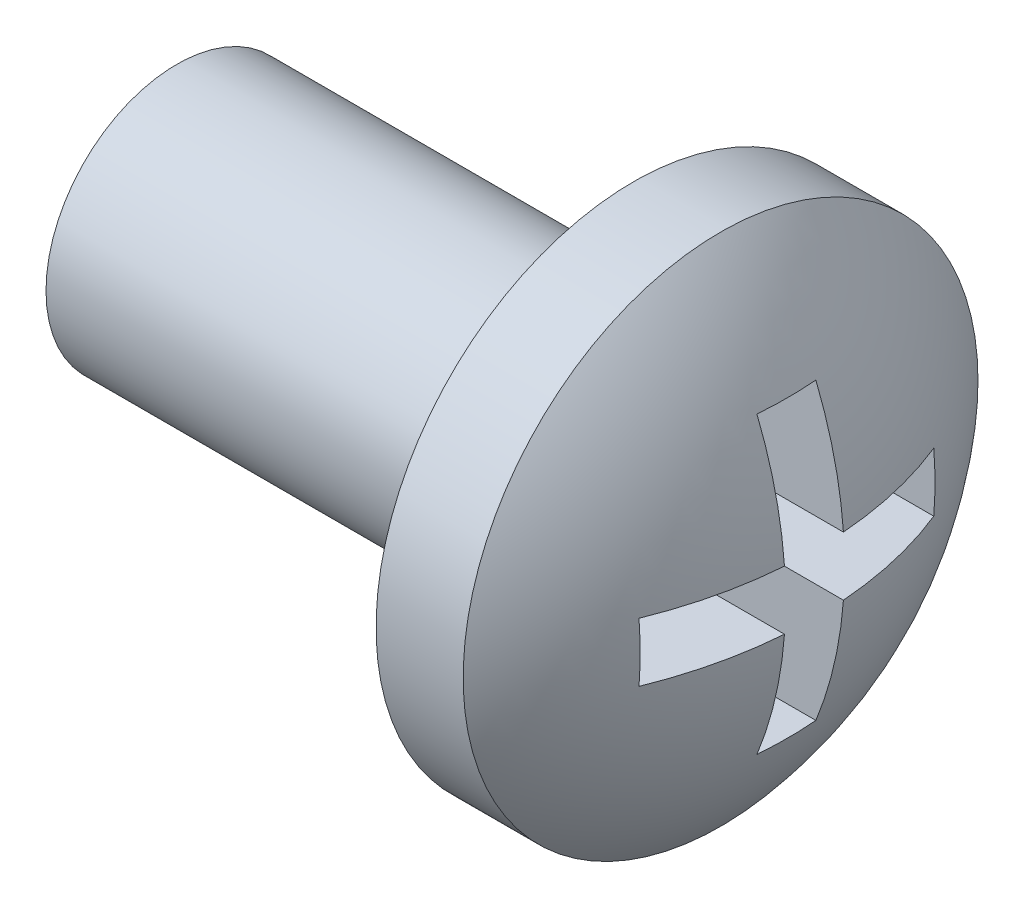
ISO-10303-21;
HEADER;
FILE_DESCRIPTION(('STEP AP214'),'2;1');
FILE_NAME('part.step','',(''),(''),'','','');
FILE_SCHEMA(('AUTOMOTIVE_DESIGN { 1 0 10303 214 1 1 1 1 }'));
ENDSEC;
DATA;
#1=APPLICATION_CONTEXT('core data for automotive mechanical design processes');
#2=APPLICATION_PROTOCOL_DEFINITION('international standard','automotive_design',2000,#1);
#3=PRODUCT_CONTEXT('',#1,'mechanical');
#4=PRODUCT('Part','Part','',(#3));
#5=PRODUCT_RELATED_PRODUCT_CATEGORY('part','',(#4));
#6=PRODUCT_DEFINITION_FORMATION('','',#4);
#7=PRODUCT_DEFINITION_CONTEXT('part definition',#1,'design');
#8=PRODUCT_DEFINITION('design','',#6,#7);
#9=PRODUCT_DEFINITION_SHAPE('','',#8);
#10=(LENGTH_UNIT() NAMED_UNIT(*) SI_UNIT(.MILLI.,.METRE.));
#11=(NAMED_UNIT(*) PLANE_ANGLE_UNIT() SI_UNIT($,.RADIAN.));
#12=(NAMED_UNIT(*) SI_UNIT($,.STERADIAN.) SOLID_ANGLE_UNIT());
#13=UNCERTAINTY_MEASURE_WITH_UNIT(LENGTH_MEASURE(1.E-05),#10,'distance_accuracy_value','');
#14=(GEOMETRIC_REPRESENTATION_CONTEXT(3) GLOBAL_UNCERTAINTY_ASSIGNED_CONTEXT((#13)) GLOBAL_UNIT_ASSIGNED_CONTEXT((#10,
#11,#12)) REPRESENTATION_CONTEXT('',''));
#15=CARTESIAN_POINT('',(0.,0.,0.));
#16=DIRECTION('',(0.,0.,1.));
#17=DIRECTION('',(1.,0.,0.));
#18=AXIS2_PLACEMENT_3D('',#15,#16,#17);
#19=CARTESIAN_POINT('',(13.8,0.,12.45));
#20=DIRECTION('',(0.,0.,1.));
#21=DIRECTION('',(1.,0.,0.));
#22=AXIS2_PLACEMENT_3D('',#19,#20,#21);
#23=PLANE('',#22);
#24=DIRECTION('',(0.,1.,0.));
#25=VECTOR('',#24,1.);
#26=CARTESIAN_POINT('',(12.2,0.,12.45));
#27=LINE('',#26,#25);
#28=CARTESIAN_POINT('',(12.2,0.71,12.45));
#29=VERTEX_POINT('',#28);
#30=CARTESIAN_POINT('',(12.2,-0.71,12.45));
#31=VERTEX_POINT('',#30);
#32=EDGE_CURVE('E182',#29,#31,#27,.F.);
#33=ORIENTED_EDGE('',*,*,#32,.T.);
#34=DIRECTION('',(1.,0.,0.));
#35=VECTOR('',#34,1.);
#36=CARTESIAN_POINT('',(13.8,-0.71,12.45));
#37=LINE('',#36,#35);
#38=CARTESIAN_POINT('',(14.6831315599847,-0.710000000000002,12.45));
#39=VERTEX_POINT('',#38);
#40=EDGE_CURVE('E120',#39,#31,#37,.F.);
#41=ORIENTED_EDGE('',*,*,#40,.F.);
#42=CARTESIAN_POINT('',(14.6831315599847,-0.710000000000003,12.45));
#43=CARTESIAN_POINT('',(14.7022317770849,-0.473333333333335,12.45));
#44=CARTESIAN_POINT('',(14.711781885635,-0.236666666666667,12.45));
#45=CARTESIAN_POINT('',(14.711781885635,0.236666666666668,12.45));
#46=CARTESIAN_POINT('',(14.7022317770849,0.473333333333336,12.45));
#47=CARTESIAN_POINT('',(14.6831315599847,0.710000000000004,12.45));
#48=B_SPLINE_CURVE_WITH_KNOTS('',3,(#42,#43,#44,#45,#46,#47),.UNSPECIFIED.,.F.,.F.,(4,2,4),(0.,
0.710577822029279,1.42115564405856),.UNSPECIFIED.);
#49=CARTESIAN_POINT('',(14.6831315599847,0.710000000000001,12.45));
#50=VERTEX_POINT('',#49);
#51=EDGE_CURVE('E112',#39,#50,#48,.T.);
#52=ORIENTED_EDGE('',*,*,#51,.T.);
#53=DIRECTION('',(1.,0.,0.));
#54=VECTOR('',#53,1.);
#55=CARTESIAN_POINT('',(13.8,0.71,12.45));
#56=LINE('',#55,#54);
#57=EDGE_CURVE('E117',#29,#50,#56,.T.);
#58=ORIENTED_EDGE('',*,*,#57,.F.);
#59=EDGE_LOOP('',(#33,#41,#52,#58));
#60=FACE_BOUND('',#59,.T.);
#61=ADVANCED_FACE('F16',(#60),#23,.T.);
#62=CARTESIAN_POINT('',(13.8,-3.55,16.));
#63=DIRECTION('',(0.,1.,0.));
#64=DIRECTION('',(0.,0.,1.));
#65=AXIS2_PLACEMENT_3D('',#62,#63,#64);
#66=PLANE('',#65);
#67=DIRECTION('',(-1.,0.,0.));
#68=VECTOR('',#67,1.);
#69=CARTESIAN_POINT('',(13.8,-3.55,16.71));
#70=LINE('',#69,#68);
#71=CARTESIAN_POINT('',(14.6831315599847,-3.55,16.71));
#72=VERTEX_POINT('',#71);
#73=CARTESIAN_POINT('',(12.2,-3.55,16.71));
#74=VERTEX_POINT('',#73);
#75=EDGE_CURVE('E252',#72,#74,#70,.T.);
#76=ORIENTED_EDGE('',*,*,#75,.F.);
#77=CARTESIAN_POINT('',(5.9,-3.55,16.));
#78=DIRECTION('',(0.,1.,0.));
#79=DIRECTION('',(0.,0.,1.));
#80=AXIS2_PLACEMENT_3D('',#77,#78,#79);
#81=CIRCLE('',#80,8.81178188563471);
#82=CARTESIAN_POINT('',(14.6831315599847,-3.55,15.29));
#83=VERTEX_POINT('',#82);
#84=EDGE_CURVE('E122',#72,#83,#81,.T.);
#85=ORIENTED_EDGE('',*,*,#84,.T.);
#86=DIRECTION('',(1.,0.,0.));
#87=VECTOR('',#86,1.);
#88=CARTESIAN_POINT('',(13.8,-3.55,15.29));
#89=LINE('',#88,#87);
#90=CARTESIAN_POINT('',(12.2,-3.55,15.29));
#91=VERTEX_POINT('',#90);
#92=EDGE_CURVE('E248',#91,#83,#89,.T.);
#93=ORIENTED_EDGE('',*,*,#92,.F.);
#94=DIRECTION('',(0.,0.,1.));
#95=VECTOR('',#94,1.);
#96=CARTESIAN_POINT('',(12.2,-3.55,16.));
#97=LINE('',#96,#95);
#98=EDGE_CURVE('E299',#91,#74,#97,.T.);
#99=ORIENTED_EDGE('',*,*,#98,.T.);
#100=EDGE_LOOP('',(#76,#85,#93,#99));
#101=FACE_BOUND('',#100,.T.);
#102=ADVANCED_FACE('F175',(#101),#66,.T.);
#103=CARTESIAN_POINT('',(13.8,0.,19.55));
#104=DIRECTION('',(0.,0.,-1.));
#105=DIRECTION('',(-1.,0.,0.));
#106=AXIS2_PLACEMENT_3D('',#103,#104,#105);
#107=PLANE('',#106);
#108=DIRECTION('',(0.,1.,0.));
#109=VECTOR('',#108,1.);
#110=CARTESIAN_POINT('',(12.2,0.,19.55));
#111=LINE('',#110,#109);
#112=CARTESIAN_POINT('',(12.2,-0.71,19.55));
#113=VERTEX_POINT('',#112);
#114=CARTESIAN_POINT('',(12.2,0.71,19.55));
#115=VERTEX_POINT('',#114);
#116=EDGE_CURVE('E284',#113,#115,#111,.T.);
#117=ORIENTED_EDGE('',*,*,#116,.T.);
#118=DIRECTION('',(1.,0.,0.));
#119=VECTOR('',#118,1.);
#120=CARTESIAN_POINT('',(13.8,0.71,19.55));
#121=LINE('',#120,#119);
#122=CARTESIAN_POINT('',(14.6831315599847,0.710000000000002,19.55));
#123=VERTEX_POINT('',#122);
#124=EDGE_CURVE('E295',#123,#115,#121,.F.);
#125=ORIENTED_EDGE('',*,*,#124,.F.);
#126=CARTESIAN_POINT('',(14.6831315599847,0.710000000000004,19.55));
#127=CARTESIAN_POINT('',(14.7022317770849,0.473333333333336,19.55));
#128=CARTESIAN_POINT('',(14.711781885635,0.236666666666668,19.55));
#129=CARTESIAN_POINT('',(14.711781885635,-0.236666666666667,19.55));
#130=CARTESIAN_POINT('',(14.7022317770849,-0.473333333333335,19.55));
#131=CARTESIAN_POINT('',(14.6831315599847,-0.710000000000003,19.55));
#132=B_SPLINE_CURVE_WITH_KNOTS('',3,(#126,#127,#128,#129,#130,#131),.UNSPECIFIED.,.F.,.F.,(4,2,
4),(0.,0.710577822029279,1.42115564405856),.UNSPECIFIED.);
#133=CARTESIAN_POINT('',(14.6831315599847,-0.710000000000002,19.55));
#134=VERTEX_POINT('',#133);
#135=EDGE_CURVE('E177',#123,#134,#132,.T.);
#136=ORIENTED_EDGE('',*,*,#135,.T.);
#137=DIRECTION('',(1.,0.,0.));
#138=VECTOR('',#137,1.);
#139=CARTESIAN_POINT('',(13.8,-0.71,19.55));
#140=LINE('',#139,#138);
#141=EDGE_CURVE('E305',#113,#134,#140,.T.);
#142=ORIENTED_EDGE('',*,*,#141,.F.);
#143=EDGE_LOOP('',(#117,#125,#136,#142));
#144=FACE_BOUND('',#143,.T.);
#145=ADVANCED_FACE('F171',(#144),#107,.T.);
#146=CARTESIAN_POINT('',(12.2,0.,16.));
#147=DIRECTION('',(-1.,0.,0.));
#148=DIRECTION('',(0.,0.,1.));
#149=AXIS2_PLACEMENT_3D('',#146,#147,#148);
#150=PLANE('',#149);
#151=DIRECTION('',(0.,0.,-1.));
#152=VECTOR('',#151,1.);
#153=CARTESIAN_POINT('',(12.2,3.55,16.));
#154=LINE('',#153,#152);
#155=CARTESIAN_POINT('',(12.2,3.55,16.71));
#156=VERTEX_POINT('',#155);
#157=CARTESIAN_POINT('',(12.2,3.55,15.29));
#158=VERTEX_POINT('',#157);
#159=EDGE_CURVE('E282',#156,#158,#154,.T.);
#160=ORIENTED_EDGE('',*,*,#159,.F.);
#161=DIRECTION('',(0.,1.,0.));
#162=VECTOR('',#161,1.);
#163=CARTESIAN_POINT('',(12.2,0.,16.71));
#164=LINE('',#163,#162);
#165=CARTESIAN_POINT('',(12.2,0.71,16.71));
#166=VERTEX_POINT('',#165);
#167=EDGE_CURVE('E287',#166,#156,#164,.T.);
#168=ORIENTED_EDGE('',*,*,#167,.F.);
#169=DIRECTION('',(0.,0.,-1.));
#170=VECTOR('',#169,1.);
#171=CARTESIAN_POINT('',(12.2,0.71,16.));
#172=LINE('',#171,#170);
#173=EDGE_CURVE('E293',#115,#166,#172,.T.);
#174=ORIENTED_EDGE('',*,*,#173,.F.);
#175=ORIENTED_EDGE('',*,*,#116,.F.);
#176=DIRECTION('',(0.,0.,1.));
#177=VECTOR('',#176,1.);
#178=CARTESIAN_POINT('',(12.2,-0.71,16.));
#179=LINE('',#178,#177);
#180=CARTESIAN_POINT('',(12.2,-0.71,16.71));
#181=VERTEX_POINT('',#180);
#182=EDGE_CURVE('E302',#181,#113,#179,.T.);
#183=ORIENTED_EDGE('',*,*,#182,.F.);
#184=DIRECTION('',(0.,1.,0.));
#185=VECTOR('',#184,1.);
#186=CARTESIAN_POINT('',(12.2,0.,16.71));
#187=LINE('',#186,#185);
#188=EDGE_CURVE('E255',#74,#181,#187,.T.);
#189=ORIENTED_EDGE('',*,*,#188,.F.);
#190=ORIENTED_EDGE('',*,*,#98,.F.);
#191=DIRECTION('',(0.,1.,0.));
#192=VECTOR('',#191,1.);
#193=CARTESIAN_POINT('',(12.2,0.,15.29));
#194=LINE('',#193,#192);
#195=CARTESIAN_POINT('',(12.2,-0.71,15.29));
#196=VERTEX_POINT('',#195);
#197=EDGE_CURVE('E250',#196,#91,#194,.F.);
#198=ORIENTED_EDGE('',*,*,#197,.F.);
#199=DIRECTION('',(0.,0.,1.));
#200=VECTOR('',#199,1.);
#201=CARTESIAN_POINT('',(12.2,-0.71,16.));
#202=LINE('',#201,#200);
#203=EDGE_CURVE('E264',#31,#196,#202,.T.);
#204=ORIENTED_EDGE('',*,*,#203,.F.);
#205=ORIENTED_EDGE('',*,*,#32,.F.);
#206=DIRECTION('',(0.,0.,-1.));
#207=VECTOR('',#206,1.);
#208=CARTESIAN_POINT('',(12.2,0.71,16.));
#209=LINE('',#208,#207);
#210=CARTESIAN_POINT('',(12.2,0.71,15.29));
#211=VERTEX_POINT('',#210);
#212=EDGE_CURVE('E131',#211,#29,#209,.T.);
#213=ORIENTED_EDGE('',*,*,#212,.F.);
#214=DIRECTION('',(0.,1.,0.));
#215=VECTOR('',#214,1.);
#216=CARTESIAN_POINT('',(12.2,0.,15.29));
#217=LINE('',#216,#215);
#218=EDGE_CURVE('E274',#158,#211,#217,.F.);
#219=ORIENTED_EDGE('',*,*,#218,.F.);
#220=EDGE_LOOP('',(#160,#168,#174,#175,#183,#189,#190,#198,#204,#205,#213,#219));
#221=FACE_BOUND('',#220,.T.);
#222=ADVANCED_FACE('F167',(#221),#150,.F.);
#223=CARTESIAN_POINT('',(13.8,3.55,16.));
#224=DIRECTION('',(0.,-1.,0.));
#225=DIRECTION('',(0.,0.,-1.));
#226=AXIS2_PLACEMENT_3D('',#223,#224,#225);
#227=PLANE('',#226);
#228=DIRECTION('',(1.,0.,0.));
#229=VECTOR('',#228,1.);
#230=CARTESIAN_POINT('',(13.8,3.55,15.29));
#231=LINE('',#230,#229);
#232=CARTESIAN_POINT('',(14.6831315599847,3.55,15.29));
#233=VERTEX_POINT('',#232);
#234=EDGE_CURVE('E277',#233,#158,#231,.F.);
#235=ORIENTED_EDGE('',*,*,#234,.F.);
#236=CARTESIAN_POINT('',(5.9,3.55,16.));
#237=DIRECTION('',(0.,1.,0.));
#238=DIRECTION('',(0.,0.,1.));
#239=AXIS2_PLACEMENT_3D('',#236,#237,#238);
#240=CIRCLE('',#239,8.81178188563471);
#241=CARTESIAN_POINT('',(14.6831315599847,3.55,16.71));
#242=VERTEX_POINT('',#241);
#243=EDGE_CURVE('E151',#233,#242,#240,.F.);
#244=ORIENTED_EDGE('',*,*,#243,.T.);
#245=DIRECTION('',(-1.,0.,0.));
#246=VECTOR('',#245,1.);
#247=CARTESIAN_POINT('',(13.8,3.55,16.71));
#248=LINE('',#247,#246);
#249=EDGE_CURVE('E142',#156,#242,#248,.F.);
#250=ORIENTED_EDGE('',*,*,#249,.F.);
#251=ORIENTED_EDGE('',*,*,#159,.T.);
#252=EDGE_LOOP('',(#235,#244,#250,#251));
#253=FACE_BOUND('',#252,.T.);
#254=ADVANCED_FACE('F162',(#253),#227,.T.);
#255=CARTESIAN_POINT('',(13.8,0.,15.29));
#256=DIRECTION('',(0.,0.,1.));
#257=DIRECTION('',(1.,0.,0.));
#258=AXIS2_PLACEMENT_3D('',#255,#256,#257);
#259=PLANE('',#258);
#260=ORIENTED_EDGE('',*,*,#234,.T.);
#261=ORIENTED_EDGE('',*,*,#218,.T.);
#262=DIRECTION('',(1.,0.,0.));
#263=VECTOR('',#262,1.);
#264=CARTESIAN_POINT('',(13.8,0.71,15.29));
#265=LINE('',#264,#263);
#266=CARTESIAN_POINT('',(15.346787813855,0.71,15.29));
#267=VERTEX_POINT('',#266);
#268=EDGE_CURVE('E272',#267,#211,#265,.F.);
#269=ORIENTED_EDGE('',*,*,#268,.F.);
#270=CARTESIAN_POINT('',(14.6831315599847,3.55000000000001,15.29));
#271=CARTESIAN_POINT('',(14.7199171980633,3.45898926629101,15.29));
#272=CARTESIAN_POINT('',(14.7552872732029,3.36740643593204,15.29));
#273=CARTESIAN_POINT('',(14.8230352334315,3.18353616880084,15.29));
#274=CARTESIAN_POINT('',(14.8554239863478,3.09125273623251,15.29));
#275=CARTESIAN_POINT('',(14.9172403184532,2.9059914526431,15.29));
#276=CARTESIAN_POINT('',(14.9466760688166,2.81301632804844,15.29));
#277=CARTESIAN_POINT('',(15.0026097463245,2.62637926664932,15.29));
#278=CARTESIAN_POINT('',(15.0291131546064,2.5327189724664,15.29));
#279=CARTESIAN_POINT('',(15.0791971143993,2.34471632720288,15.29));
#280=CARTESIAN_POINT('',(15.1027804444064,2.25037471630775,15.29));
#281=CARTESIAN_POINT('',(15.147031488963,2.06101016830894,15.29));
#282=CARTESIAN_POINT('',(15.1676992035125,1.96598723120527,15.29));
#283=CARTESIAN_POINT('',(15.2061178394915,1.77525861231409,15.29));
#284=CARTESIAN_POINT('',(15.2238659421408,1.67955236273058,15.29));
#285=CARTESIAN_POINT('',(15.2564354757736,1.48745552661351,15.29));
#286=CARTESIAN_POINT('',(15.271251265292,1.39106398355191,15.29));
#287=CARTESIAN_POINT('',(15.2979376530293,1.1975934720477,15.29));
#288=CARTESIAN_POINT('',(15.3097997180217,1.10051332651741,15.29));
#289=CARTESIAN_POINT('',(15.3305523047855,0.905661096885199,15.29));
#290=CARTESIAN_POINT('',(15.3394313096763,0.8078877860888,15.29));
#291=CARTESIAN_POINT('',(15.346787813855,0.710000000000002,15.29));
#292=B_SPLINE_CURVE_WITH_KNOTS('',3,(#270,#271,#272,#273,#274,#275,#276,#277,#278,#279,#280,
#281,#282,#283,#284,#285,#286,#287,#288,#289,#290,#291),.UNSPECIFIED.,.F.,.F.,(4,2,2,2,2,2,2,2,
2,2,4),(0.,0.294479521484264,0.587839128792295,0.880363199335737,1.17233090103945,
1.4640186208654,1.75570634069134,2.04767404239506,2.3401981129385,2.63355772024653,
2.9280372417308),.UNSPECIFIED.);
#293=EDGE_CURVE('E137',#233,#267,#292,.T.);
#294=ORIENTED_EDGE('',*,*,#293,.F.);
#295=EDGE_LOOP('',(#260,#261,#269,#294));
#296=FACE_BOUND('',#295,.T.);
#297=ADVANCED_FACE('F157',(#296),#259,.T.);
#298=CARTESIAN_POINT('',(13.8,0.71,16.));
#299=DIRECTION('',(0.,-1.,0.));
#300=DIRECTION('',(0.,0.,-1.));
#301=AXIS2_PLACEMENT_3D('',#298,#299,#300);
#302=PLANE('',#301);
#303=ORIENTED_EDGE('',*,*,#212,.T.);
#304=ORIENTED_EDGE('',*,*,#57,.T.);
#305=CARTESIAN_POINT('',(5.9,0.71,16.));
#306=DIRECTION('',(0.,1.,0.));
#307=DIRECTION('',(0.,0.,1.));
#308=AXIS2_PLACEMENT_3D('',#305,#306,#307);
#309=CIRCLE('',#308,9.47343126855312);
#310=EDGE_CURVE('E128',#267,#50,#309,.T.);
#311=ORIENTED_EDGE('',*,*,#310,.F.);
#312=ORIENTED_EDGE('',*,*,#268,.T.);
#313=EDGE_LOOP('',(#303,#304,#311,#312));
#314=FACE_BOUND('',#313,.T.);
#315=ADVANCED_FACE('F126',(#314),#302,.T.);
#316=CARTESIAN_POINT('',(13.8,-0.71,16.));
#317=DIRECTION('',(0.,1.,0.));
#318=DIRECTION('',(0.,0.,1.));
#319=AXIS2_PLACEMENT_3D('',#316,#317,#318);
#320=PLANE('',#319);
#321=ORIENTED_EDGE('',*,*,#203,.T.);
#322=DIRECTION('',(1.,0.,0.));
#323=VECTOR('',#322,1.);
#324=CARTESIAN_POINT('',(13.8,-0.71,15.29));
#325=LINE('',#324,#323);
#326=CARTESIAN_POINT('',(15.346787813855,-0.710000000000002,15.29));
#327=VERTEX_POINT('',#326);
#328=EDGE_CURVE('E246',#327,#196,#325,.F.);
#329=ORIENTED_EDGE('',*,*,#328,.F.);
#330=CARTESIAN_POINT('',(5.9,-0.710000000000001,16.));
#331=DIRECTION('',(0.,1.,0.));
#332=DIRECTION('',(0.,0.,1.));
#333=AXIS2_PLACEMENT_3D('',#330,#331,#332);
#334=CIRCLE('',#333,9.47343126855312);
#335=EDGE_CURVE('E138',#39,#327,#334,.F.);
#336=ORIENTED_EDGE('',*,*,#335,.F.);
#337=ORIENTED_EDGE('',*,*,#40,.T.);
#338=EDGE_LOOP('',(#321,#329,#336,#337));
#339=FACE_BOUND('',#338,.T.);
#340=ADVANCED_FACE('F331',(#339),#320,.T.);
#341=CARTESIAN_POINT('',(13.8,0.,15.29));
#342=DIRECTION('',(0.,0.,1.));
#343=DIRECTION('',(1.,0.,0.));
#344=AXIS2_PLACEMENT_3D('',#341,#342,#343);
#345=PLANE('',#344);
#346=ORIENTED_EDGE('',*,*,#92,.T.);
#347=CARTESIAN_POINT('',(15.346787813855,-0.710000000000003,15.29));
#348=CARTESIAN_POINT('',(15.3394313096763,-0.807887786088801,15.29));
#349=CARTESIAN_POINT('',(15.3305523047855,-0.9056610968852,15.29));
#350=CARTESIAN_POINT('',(15.3097997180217,-1.10051332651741,15.29));
#351=CARTESIAN_POINT('',(15.2979376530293,-1.1975934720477,15.29));
#352=CARTESIAN_POINT('',(15.271251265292,-1.39106398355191,15.29));
#353=CARTESIAN_POINT('',(15.2564354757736,-1.48745552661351,15.29));
#354=CARTESIAN_POINT('',(15.2238659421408,-1.67955236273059,15.29));
#355=CARTESIAN_POINT('',(15.2061178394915,-1.7752586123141,15.29));
#356=CARTESIAN_POINT('',(15.1676992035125,-1.96598723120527,15.29));
#357=CARTESIAN_POINT('',(15.147031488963,-2.06101016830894,15.29));
#358=CARTESIAN_POINT('',(15.1027804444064,-2.25037471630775,15.29));
#359=CARTESIAN_POINT('',(15.0791971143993,-2.34471632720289,15.29));
#360=CARTESIAN_POINT('',(15.0291131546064,-2.5327189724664,15.29));
#361=CARTESIAN_POINT('',(15.0026097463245,-2.62637926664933,15.29));
#362=CARTESIAN_POINT('',(14.9466760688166,-2.81301632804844,15.29));
#363=CARTESIAN_POINT('',(14.9172403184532,-2.90599145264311,15.29));
#364=CARTESIAN_POINT('',(14.8554239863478,-3.09125273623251,15.29));
#365=CARTESIAN_POINT('',(14.8230352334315,-3.18353616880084,15.29));
#366=CARTESIAN_POINT('',(14.7552872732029,-3.36740643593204,15.29));
#367=CARTESIAN_POINT('',(14.7199171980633,-3.45898926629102,15.29));
#368=CARTESIAN_POINT('',(14.6831315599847,-3.55000000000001,15.29));
#369=B_SPLINE_CURVE_WITH_KNOTS('',3,(#347,#348,#349,#350,#351,#352,#353,#354,#355,#356,#357,
#358,#359,#360,#361,#362,#363,#364,#365,#366,#367,#368),.UNSPECIFIED.,.F.,.F.,(4,2,2,2,2,2,2,2,
2,2,4),(0.,0.294479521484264,0.587839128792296,0.880363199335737,1.17233090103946,
1.4640186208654,1.75570634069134,2.04767404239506,2.3401981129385,2.63355772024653,
2.9280372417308),.UNSPECIFIED.);
#370=EDGE_CURVE('E140',#327,#83,#369,.T.);
#371=ORIENTED_EDGE('',*,*,#370,.F.);
#372=ORIENTED_EDGE('',*,*,#328,.T.);
#373=ORIENTED_EDGE('',*,*,#197,.T.);
#374=EDGE_LOOP('',(#346,#371,#372,#373));
#375=FACE_BOUND('',#374,.T.);
#376=ADVANCED_FACE('F227',(#375),#345,.T.);
#377=CARTESIAN_POINT('',(13.8,0.,16.71));
#378=DIRECTION('',(0.,0.,-1.));
#379=DIRECTION('',(-1.,0.,0.));
#380=AXIS2_PLACEMENT_3D('',#377,#378,#379);
#381=PLANE('',#380);
#382=ORIENTED_EDGE('',*,*,#75,.T.);
#383=ORIENTED_EDGE('',*,*,#188,.T.);
#384=DIRECTION('',(1.,0.,0.));
#385=VECTOR('',#384,1.);
#386=CARTESIAN_POINT('',(13.8,-0.71,16.71));
#387=LINE('',#386,#385);
#388=CARTESIAN_POINT('',(15.346787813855,-0.71,16.71));
#389=VERTEX_POINT('',#388);
#390=EDGE_CURVE('E306',#389,#181,#387,.F.);
#391=ORIENTED_EDGE('',*,*,#390,.F.);
#392=CARTESIAN_POINT('',(14.6831315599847,-3.55000000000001,16.71));
#393=CARTESIAN_POINT('',(14.7199171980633,-3.45898926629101,16.71));
#394=CARTESIAN_POINT('',(14.7552872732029,-3.36740643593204,16.71));
#395=CARTESIAN_POINT('',(14.8230352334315,-3.18353616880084,16.71));
#396=CARTESIAN_POINT('',(14.8554239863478,-3.09125273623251,16.71));
#397=CARTESIAN_POINT('',(14.9172403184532,-2.9059914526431,16.71));
#398=CARTESIAN_POINT('',(14.9466760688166,-2.81301632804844,16.71));
#399=CARTESIAN_POINT('',(15.0026097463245,-2.62637926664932,16.71));
#400=CARTESIAN_POINT('',(15.0291131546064,-2.5327189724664,16.71));
#401=CARTESIAN_POINT('',(15.0791971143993,-2.34471632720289,16.71));
#402=CARTESIAN_POINT('',(15.1027804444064,-2.25037471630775,16.71));
#403=CARTESIAN_POINT('',(15.147031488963,-2.06101016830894,16.71));
#404=CARTESIAN_POINT('',(15.1676992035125,-1.96598723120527,16.71));
#405=CARTESIAN_POINT('',(15.2061178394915,-1.7752586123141,16.71));
#406=CARTESIAN_POINT('',(15.2238659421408,-1.67955236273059,16.71));
#407=CARTESIAN_POINT('',(15.2564354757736,-1.48745552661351,16.71));
#408=CARTESIAN_POINT('',(15.271251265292,-1.39106398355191,16.71));
#409=CARTESIAN_POINT('',(15.2979376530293,-1.1975934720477,16.71));
#410=CARTESIAN_POINT('',(15.3097997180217,-1.10051332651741,16.71));
#411=CARTESIAN_POINT('',(15.3305523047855,-0.9056610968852,16.71));
#412=CARTESIAN_POINT('',(15.3394313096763,-0.807887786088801,16.71));
#413=CARTESIAN_POINT('',(15.346787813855,-0.710000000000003,16.71));
#414=B_SPLINE_CURVE_WITH_KNOTS('',3,(#392,#393,#394,#395,#396,#397,#398,#399,#400,#401,#402,
#403,#404,#405,#406,#407,#408,#409,#410,#411,#412,#413),.UNSPECIFIED.,.F.,.F.,(4,2,2,2,2,2,2,2,
2,2,4),(0.,0.294479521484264,0.587839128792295,0.880363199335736,1.17233090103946,
1.4640186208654,1.75570634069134,2.04767404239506,2.3401981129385,2.63355772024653,
2.9280372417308),.UNSPECIFIED.);
#415=EDGE_CURVE('E231',#72,#389,#414,.T.);
#416=ORIENTED_EDGE('',*,*,#415,.F.);
#417=EDGE_LOOP('',(#382,#383,#391,#416));
#418=FACE_BOUND('',#417,.T.);
#419=ADVANCED_FACE('F222',(#418),#381,.T.);
#420=CARTESIAN_POINT('',(13.8,-0.71,16.));
#421=DIRECTION('',(0.,1.,0.));
#422=DIRECTION('',(0.,0.,1.));
#423=AXIS2_PLACEMENT_3D('',#420,#421,#422);
#424=PLANE('',#423);
#425=ORIENTED_EDGE('',*,*,#141,.T.);
#426=CARTESIAN_POINT('',(5.9,-0.710000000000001,16.));
#427=DIRECTION('',(0.,1.,0.));
#428=DIRECTION('',(0.,0.,1.));
#429=AXIS2_PLACEMENT_3D('',#426,#427,#428);
#430=CIRCLE('',#429,9.47343126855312);
#431=EDGE_CURVE('E236',#389,#134,#430,.F.);
#432=ORIENTED_EDGE('',*,*,#431,.F.);
#433=ORIENTED_EDGE('',*,*,#390,.T.);
#434=ORIENTED_EDGE('',*,*,#182,.T.);
#435=EDGE_LOOP('',(#425,#432,#433,#434));
#436=FACE_BOUND('',#435,.T.);
#437=ADVANCED_FACE('F218',(#436),#424,.T.);
#438=CARTESIAN_POINT('',(13.8,0.71,16.));
#439=DIRECTION('',(0.,-1.,0.));
#440=DIRECTION('',(0.,0.,-1.));
#441=AXIS2_PLACEMENT_3D('',#438,#439,#440);
#442=PLANE('',#441);
#443=ORIENTED_EDGE('',*,*,#124,.T.);
#444=ORIENTED_EDGE('',*,*,#173,.T.);
#445=DIRECTION('',(-1.,0.,0.));
#446=VECTOR('',#445,1.);
#447=CARTESIAN_POINT('',(13.8,0.71,16.71));
#448=LINE('',#447,#446);
#449=CARTESIAN_POINT('',(15.346787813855,0.710000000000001,16.71));
#450=VERTEX_POINT('',#449);
#451=EDGE_CURVE('E290',#450,#166,#448,.T.);
#452=ORIENTED_EDGE('',*,*,#451,.F.);
#453=CARTESIAN_POINT('',(5.9,0.71,16.));
#454=DIRECTION('',(0.,1.,0.));
#455=DIRECTION('',(0.,0.,1.));
#456=AXIS2_PLACEMENT_3D('',#453,#454,#455);
#457=CIRCLE('',#456,9.47343126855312);
#458=EDGE_CURVE('E208',#123,#450,#457,.T.);
#459=ORIENTED_EDGE('',*,*,#458,.F.);
#460=EDGE_LOOP('',(#443,#444,#452,#459));
#461=FACE_BOUND('',#460,.T.);
#462=ADVANCED_FACE('F214',(#461),#442,.T.);
#463=CARTESIAN_POINT('',(13.8,0.,16.71));
#464=DIRECTION('',(0.,0.,-1.));
#465=DIRECTION('',(-1.,0.,0.));
#466=AXIS2_PLACEMENT_3D('',#463,#464,#465);
#467=PLANE('',#466);
#468=ORIENTED_EDGE('',*,*,#249,.T.);
#469=CARTESIAN_POINT('',(15.346787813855,0.710000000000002,16.71));
#470=CARTESIAN_POINT('',(15.3394313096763,0.8078877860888,16.71));
#471=CARTESIAN_POINT('',(15.3305523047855,0.905661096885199,16.71));
#472=CARTESIAN_POINT('',(15.3097997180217,1.10051332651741,16.71));
#473=CARTESIAN_POINT('',(15.2979376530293,1.1975934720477,16.71));
#474=CARTESIAN_POINT('',(15.271251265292,1.39106398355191,16.71));
#475=CARTESIAN_POINT('',(15.2564354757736,1.48745552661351,16.71));
#476=CARTESIAN_POINT('',(15.2238659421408,1.67955236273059,16.71));
#477=CARTESIAN_POINT('',(15.2061178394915,1.77525861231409,16.71));
#478=CARTESIAN_POINT('',(15.1676992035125,1.96598723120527,16.71));
#479=CARTESIAN_POINT('',(15.147031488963,2.06101016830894,16.71));
#480=CARTESIAN_POINT('',(15.1027804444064,2.25037471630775,16.71));
#481=CARTESIAN_POINT('',(15.0791971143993,2.34471632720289,16.71));
#482=CARTESIAN_POINT('',(15.0291131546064,2.5327189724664,16.71));
#483=CARTESIAN_POINT('',(15.0026097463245,2.62637926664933,16.71));
#484=CARTESIAN_POINT('',(14.9466760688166,2.81301632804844,16.71));
#485=CARTESIAN_POINT('',(14.9172403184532,2.9059914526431,16.71));
#486=CARTESIAN_POINT('',(14.8554239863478,3.09125273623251,16.71));
#487=CARTESIAN_POINT('',(14.8230352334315,3.18353616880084,16.71));
#488=CARTESIAN_POINT('',(14.7552872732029,3.36740643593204,16.71));
#489=CARTESIAN_POINT('',(14.7199171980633,3.45898926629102,16.71));
#490=CARTESIAN_POINT('',(14.6831315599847,3.55000000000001,16.71));
#491=B_SPLINE_CURVE_WITH_KNOTS('',3,(#469,#470,#471,#472,#473,#474,#475,#476,#477,#478,#479,
#480,#481,#482,#483,#484,#485,#486,#487,#488,#489,#490),.UNSPECIFIED.,.F.,.F.,(4,2,2,2,2,2,2,2,
2,2,4),(0.,0.294479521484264,0.587839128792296,0.880363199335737,1.17233090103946,
1.4640186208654,1.75570634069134,2.04767404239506,2.3401981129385,2.63355772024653,
2.9280372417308),.UNSPECIFIED.);
#492=EDGE_CURVE('E199',#450,#242,#491,.T.);
#493=ORIENTED_EDGE('',*,*,#492,.F.);
#494=ORIENTED_EDGE('',*,*,#451,.T.);
#495=ORIENTED_EDGE('',*,*,#167,.T.);
#496=EDGE_LOOP('',(#468,#493,#494,#495));
#497=FACE_BOUND('',#496,.T.);
#498=ADVANCED_FACE('F210',(#497),#467,.T.);
#499=CARTESIAN_POINT('',(5.9,0.,16.));
#500=DIRECTION('',(0.,1.,0.));
#501=DIRECTION('',(0.,0.,-1.));
#502=AXIS2_PLACEMENT_3D('',#499,#500,#501);
#503=SPHERICAL_SURFACE('',#502,9.5);
#504=ORIENTED_EDGE('',*,*,#370,.T.);
#505=ORIENTED_EDGE('',*,*,#84,.F.);
#506=ORIENTED_EDGE('',*,*,#415,.T.);
#507=ORIENTED_EDGE('',*,*,#431,.T.);
#508=ORIENTED_EDGE('',*,*,#135,.F.);
#509=ORIENTED_EDGE('',*,*,#458,.T.);
#510=ORIENTED_EDGE('',*,*,#492,.T.);
#511=ORIENTED_EDGE('',*,*,#243,.F.);
#512=ORIENTED_EDGE('',*,*,#293,.T.);
#513=ORIENTED_EDGE('',*,*,#310,.T.);
#514=ORIENTED_EDGE('',*,*,#51,.F.);
#515=ORIENTED_EDGE('',*,*,#335,.T.);
#516=EDGE_LOOP('',(#504,#505,#506,#507,#508,#509,#510,#511,#512,#513,#514,#515));
#517=FACE_BOUND('',#516,.T.);
#518=CARTESIAN_POINT('',(13.0979163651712,0.,16.));
#519=DIRECTION('',(1.,0.,0.));
#520=DIRECTION('',(0.,0.,-1.));
#521=AXIS2_PLACEMENT_3D('',#518,#519,#520);
#522=CIRCLE('',#521,6.2);
#523=CARTESIAN_POINT('',(13.0979163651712,0.,9.8));
#524=VERTEX_POINT('',#523);
#525=EDGE_CURVE('E194',#524,#524,#522,.F.);
#526=ORIENTED_EDGE('',*,*,#525,.F.);
#527=EDGE_LOOP('',(#526));
#528=FACE_BOUND('',#527,.T.);
#529=ADVANCED_FACE('F134',(#517,#528),#503,.T.);
#530=CARTESIAN_POINT('',(12.0489581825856,0.,16.));
#531=DIRECTION('',(1.,0.,0.));
#532=DIRECTION('',(0.,0.,-1.));
#533=AXIS2_PLACEMENT_3D('',#530,#531,#532);
#534=CYLINDRICAL_SURFACE('',#533,6.2);
#535=CARTESIAN_POINT('',(11.,0.,16.));
#536=DIRECTION('',(1.,0.,0.));
#537=DIRECTION('',(0.,0.,-1.));
#538=AXIS2_PLACEMENT_3D('',#535,#536,#537);
#539=CIRCLE('',#538,6.2);
#540=CARTESIAN_POINT('',(11.,0.,9.8));
#541=VERTEX_POINT('',#540);
#542=EDGE_CURVE('E192',#541,#541,#539,.F.);
#543=ORIENTED_EDGE('',*,*,#542,.F.);
#544=EDGE_LOOP('',(#543));
#545=FACE_BOUND('',#544,.T.);
#546=ORIENTED_EDGE('',*,*,#525,.T.);
#547=EDGE_LOOP('',(#546));
#548=FACE_BOUND('',#547,.T.);
#549=ADVANCED_FACE('F535',(#545,#548),#534,.T.);
#550=CARTESIAN_POINT('',(11.,0.,16.));
#551=DIRECTION('',(-1.,0.,0.));
#552=DIRECTION('',(0.,0.,1.));
#553=AXIS2_PLACEMENT_3D('',#550,#551,#552);
#554=PLANE('',#553);
#555=ORIENTED_EDGE('',*,*,#542,.T.);
#556=EDGE_LOOP('',(#555));
#557=FACE_BOUND('',#556,.T.);
#558=CARTESIAN_POINT('',(11.,0.,16.));
#559=DIRECTION('',(-1.,0.,0.));
#560=DIRECTION('',(0.,-1.,0.));
#561=AXIS2_PLACEMENT_3D('',#558,#559,#560);
#562=CIRCLE('',#561,3.95);
#563=CARTESIAN_POINT('',(11.,3.95,16.));
#564=VERTEX_POINT('',#563);
#565=CARTESIAN_POINT('',(11.,-3.95,16.));
#566=VERTEX_POINT('',#565);
#567=EDGE_CURVE('E187',#564,#566,#562,.F.);
#568=ORIENTED_EDGE('',*,*,#567,.T.);
#569=CARTESIAN_POINT('',(11.,0.,16.));
#570=DIRECTION('',(-1.,0.,0.));
#571=DIRECTION('',(0.,1.,0.));
#572=AXIS2_PLACEMENT_3D('',#569,#570,#571);
#573=CIRCLE('',#572,3.95);
#574=EDGE_CURVE('E36',#566,#564,#573,.F.);
#575=ORIENTED_EDGE('',*,*,#574,.T.);
#576=EDGE_LOOP('',(#568,#575));
#577=FACE_BOUND('',#576,.T.);
#578=ADVANCED_FACE('F354',(#557,#577),#554,.T.);
#579=CARTESIAN_POINT('',(10.2,0.,16.));
#580=DIRECTION('',(-1.,0.,0.));
#581=DIRECTION('',(0.,1.,0.));
#582=AXIS2_PLACEMENT_3D('',#579,#580,#581);
#583=TOROIDAL_SURFACE('',#582,3.95,0.8);
#584=ORIENTED_EDGE('',*,*,#574,.F.);
#585=ORIENTED_EDGE('',*,*,#567,.F.);
#586=EDGE_LOOP('',(#584,#585));
#587=FACE_BOUND('',#586,.T.);
#588=CARTESIAN_POINT('',(10.2,0.,16.));
#589=DIRECTION('',(1.,0.,0.));
#590=DIRECTION('',(0.,0.,-1.));
#591=AXIS2_PLACEMENT_3D('',#588,#589,#590);
#592=CIRCLE('',#591,3.15);
#593=CARTESIAN_POINT('',(10.2,0.,12.85));
#594=VERTEX_POINT('',#593);
#595=EDGE_CURVE('E28',#594,#594,#592,.F.);
#596=ORIENTED_EDGE('',*,*,#595,.F.);
#597=EDGE_LOOP('',(#596));
#598=FACE_BOUND('',#597,.T.);
#599=ADVANCED_FACE('F188',(#587,#598),#583,.F.);
#600=CARTESIAN_POINT('',(0.,0.,16.));
#601=DIRECTION('',(-1.,0.,0.));
#602=DIRECTION('',(0.,0.,1.));
#603=AXIS2_PLACEMENT_3D('',#600,#601,#602);
#604=PLANE('',#603);
#605=CARTESIAN_POINT('',(0.,0.,16.));
#606=DIRECTION('',(1.,0.,0.));
#607=DIRECTION('',(0.,0.,-1.));
#608=AXIS2_PLACEMENT_3D('',#605,#606,#607);
#609=CIRCLE('',#608,3.15);
#610=CARTESIAN_POINT('',(0.,0.,12.85));
#611=VERTEX_POINT('',#610);
#612=EDGE_CURVE('E10',#611,#611,#609,.T.);
#613=ORIENTED_EDGE('',*,*,#612,.F.);
#614=EDGE_LOOP('',(#613));
#615=FACE_BOUND('',#614,.T.);
#616=ADVANCED_FACE('F340',(#615),#604,.T.);
#617=CARTESIAN_POINT('',(5.5,0.,16.));
#618=DIRECTION('',(1.,0.,0.));
#619=DIRECTION('',(0.,0.,-1.));
#620=AXIS2_PLACEMENT_3D('',#617,#618,#619);
#621=CYLINDRICAL_SURFACE('',#620,3.15);
#622=ORIENTED_EDGE('',*,*,#595,.T.);
#623=EDGE_LOOP('',(#622));
#624=FACE_BOUND('',#623,.T.);
#625=ORIENTED_EDGE('',*,*,#612,.T.);
#626=EDGE_LOOP('',(#625));
#627=FACE_BOUND('',#626,.T.);
#628=ADVANCED_FACE('F338',(#624,#627),#621,.T.);
#629=CLOSED_SHELL('',(#61,#102,#145,#222,#254,#297,#315,#340,#376,#419,#437,#462,#498,#529,#549,
#578,#599,#616,#628));
#630=MANIFOLD_SOLID_BREP('B1',#629);
#631=ADVANCED_BREP_SHAPE_REPRESENTATION('',(#18,#630),#14);
#632=SHAPE_DEFINITION_REPRESENTATION(#9,#631);
ENDSEC;
END-ISO-10303-21;
